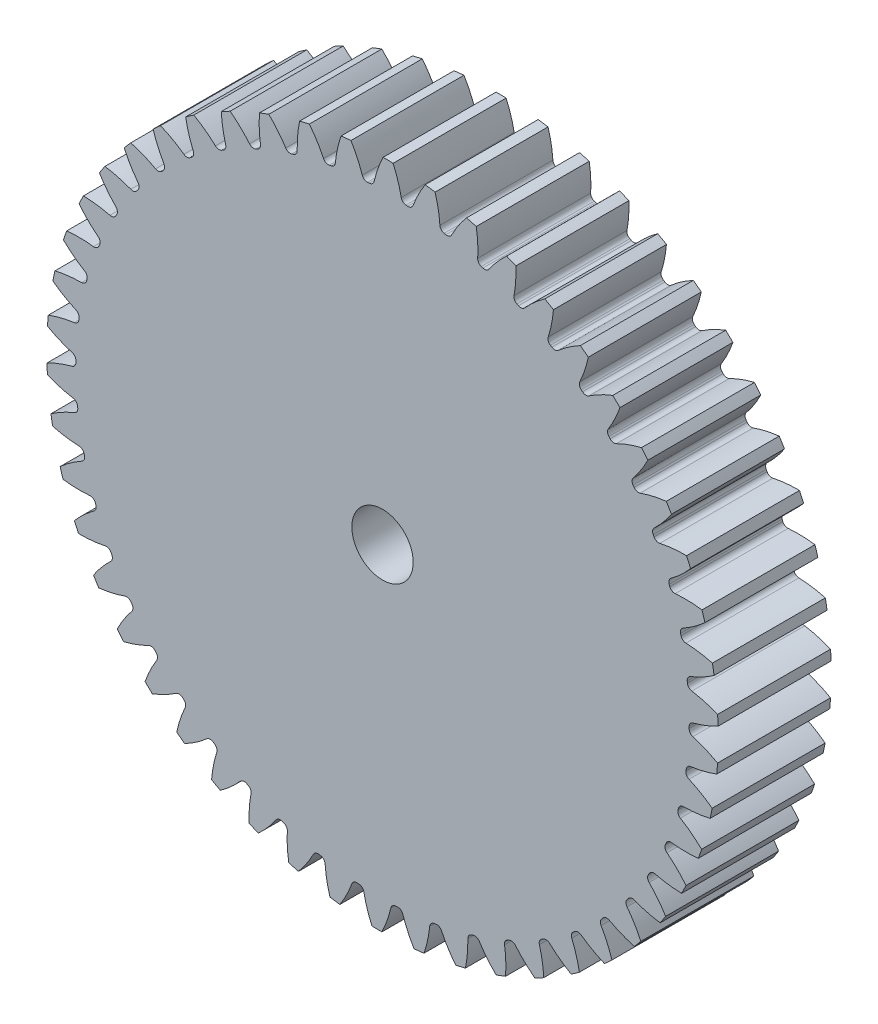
from build123d import *

# Parameters (mm, degrees)
SKETCH3_R         = 264.16
GEARBODY_DEPTH    = 88.9
TOOTHCUT_DEPTH    = 385.010704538
CIRPATTERN1_COUNT = 50
BOREDIA_R         = 24.13
BORE_DEPTH        = 12700


with BuildPart() as part:
    # Sketch3 → gearBody (new body)
    with BuildSketch(Plane.XY):
        Circle(SKETCH3_R)
    extrude(amount=GEARBODY_DEPTH)

    # Sketch2 → toothCut (cut, through all)
    with BuildSketch(Plane.XY):
        with BuildLine():
            ThreePointArc((241.25371803, -4.725837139), (241.266515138, -4.019785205), (241.277245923, -3.313698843))
            ThreePointArc((241.277245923, -3.313698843), (242.154734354, -0.823016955), (244.360606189, 0.628744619))
            ThreePointArc((244.360606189, 0.628744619), (254.478755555, 3.912475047), (264.16, 8.320801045))
            ThreePointArc((264.16, 8.320801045), (264.25434107, -4.402789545), (263.73618992, -17.116175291))
            ThreePointArc((263.73618992, -17.116175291), (254.207173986, -12.387783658), (244.204031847, -8.768808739))
            ThreePointArc((244.204031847, -8.768808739), (242.047747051, -7.244368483), (241.25371803, -4.725837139))
        make_face()
    toothcut = extrude(amount=TOOTHCUT_DEPTH, mode=Mode.SUBTRACT)

    # CirPattern1: toothCut ×50 about axis
    cirpattern1_axis = Axis((0, 0, 0), (0, 0, 1))
    for i in range(1, CIRPATTERN1_COUNT):
        add(toothcut.rotate(cirpattern1_axis, i * 360 / CIRPATTERN1_COUNT), mode=Mode.SUBTRACT)

    # boreDia → bore (cut, symmetric)
    with BuildSketch(Plane.XY):
        Circle(BOREDIA_R)
    extrude(amount=BORE_DEPTH, both=True, mode=Mode.SUBTRACT)


solid = part.part
